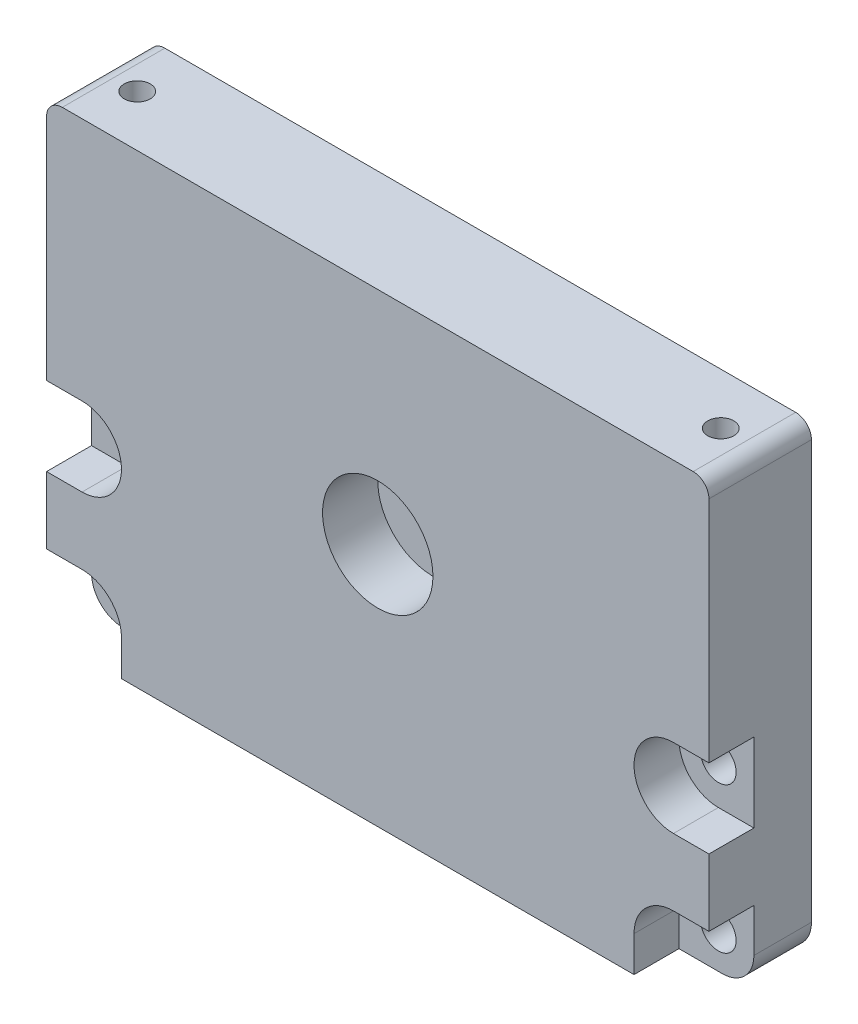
ISO-10303-21;
HEADER;
FILE_DESCRIPTION(('STEP AP214'),'2;1');
FILE_NAME('part.step','',(''),(''),'','','');
FILE_SCHEMA(('AUTOMOTIVE_DESIGN { 1 0 10303 214 1 1 1 1 }'));
ENDSEC;
DATA;
#1=APPLICATION_CONTEXT('core data for automotive mechanical design processes');
#2=APPLICATION_PROTOCOL_DEFINITION('international standard','automotive_design',2000,#1);
#3=PRODUCT_CONTEXT('',#1,'mechanical');
#4=PRODUCT('Part','Part','',(#3));
#5=PRODUCT_RELATED_PRODUCT_CATEGORY('part','',(#4));
#6=PRODUCT_DEFINITION_FORMATION('','',#4);
#7=PRODUCT_DEFINITION_CONTEXT('part definition',#1,'design');
#8=PRODUCT_DEFINITION('design','',#6,#7);
#9=PRODUCT_DEFINITION_SHAPE('','',#8);
#10=(LENGTH_UNIT() NAMED_UNIT(*) SI_UNIT(.MILLI.,.METRE.));
#11=(NAMED_UNIT(*) PLANE_ANGLE_UNIT() SI_UNIT($,.RADIAN.));
#12=(NAMED_UNIT(*) SI_UNIT($,.STERADIAN.) SOLID_ANGLE_UNIT());
#13=UNCERTAINTY_MEASURE_WITH_UNIT(LENGTH_MEASURE(1.E-05),#10,'distance_accuracy_value','');
#14=(GEOMETRIC_REPRESENTATION_CONTEXT(3) GLOBAL_UNCERTAINTY_ASSIGNED_CONTEXT((#13)) GLOBAL_UNIT_ASSIGNED_CONTEXT((#10,
#11,#12)) REPRESENTATION_CONTEXT('',''));
#15=CARTESIAN_POINT('',(0.,0.,0.));
#16=DIRECTION('',(0.,0.,1.));
#17=DIRECTION('',(1.,0.,0.));
#18=AXIS2_PLACEMENT_3D('',#15,#16,#17);
#19=CARTESIAN_POINT('',(-54.6053033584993,-1.18056755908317,6.));
#20=DIRECTION('',(0.,0.,1.));
#21=DIRECTION('',(1.,0.,0.));
#22=AXIS2_PLACEMENT_3D('',#19,#20,#21);
#23=PLANE('',#22);
#24=CARTESIAN_POINT('',(-54.6053033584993,-1.18056755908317,6.));
#25=DIRECTION('',(0.,0.,1.));
#26=DIRECTION('',(1.,0.,0.));
#27=AXIS2_PLACEMENT_3D('',#24,#25,#26);
#28=CIRCLE('',#27,7.);
#29=CARTESIAN_POINT('',(-47.6053033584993,-1.18056755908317,6.));
#30=VERTEX_POINT('',#29);
#31=EDGE_CURVE('E20',#30,#30,#28,.T.);
#32=ORIENTED_EDGE('',*,*,#31,.T.);
#33=EDGE_LOOP('',(#32));
#34=FACE_BOUND('',#33,.T.);
#35=ADVANCED_FACE('F17',(#34),#23,.T.);
#36=CARTESIAN_POINT('',(-91.6053033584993,16.7194324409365,6.5));
#37=DIRECTION('',(0.,1.,0.));
#38=DIRECTION('',(0.,0.,1.));
#39=AXIS2_PLACEMENT_3D('',#36,#37,#38);
#40=CONICAL_SURFACE('',#39,1.65000000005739,1.02974425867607);
#41=CARTESIAN_POINT('',(-91.6053033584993,15.7280124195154,6.5));
#42=VERTEX_POINT('',#41);
#43=VERTEX_LOOP('',#42);
#44=FACE_BOUND('',#43,.T.);
#45=CARTESIAN_POINT('',(-91.6053033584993,16.7194324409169,6.5));
#46=DIRECTION('',(0.,1.,0.));
#47=DIRECTION('',(0.,0.,1.));
#48=AXIS2_PLACEMENT_3D('',#45,#46,#47);
#49=CIRCLE('',#48,1.65);
#50=CARTESIAN_POINT('',(-91.6053033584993,16.7194324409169,8.15));
#51=VERTEX_POINT('',#50);
#52=EDGE_CURVE('E163',#51,#51,#49,.T.);
#53=ORIENTED_EDGE('',*,*,#52,.T.);
#54=EDGE_LOOP('',(#53));
#55=FACE_BOUND('',#54,.T.);
#56=ADVANCED_FACE('F157',(#44,#55),#40,.F.);
#57=CARTESIAN_POINT('',(-17.6053033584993,16.7194324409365,6.5));
#58=DIRECTION('',(0.,1.,0.));
#59=DIRECTION('',(0.,0.,1.));
#60=AXIS2_PLACEMENT_3D('',#57,#58,#59);
#61=CONICAL_SURFACE('',#60,1.65000000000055,1.02974425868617);
#62=CARTESIAN_POINT('',(-17.6053033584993,15.7280124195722,6.5));
#63=VERTEX_POINT('',#62);
#64=VERTEX_LOOP('',#63);
#65=FACE_BOUND('',#64,.T.);
#66=CARTESIAN_POINT('',(-17.6053033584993,16.7194324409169,6.5));
#67=DIRECTION('',(0.,1.,0.));
#68=DIRECTION('',(0.,0.,1.));
#69=AXIS2_PLACEMENT_3D('',#66,#67,#68);
#70=CIRCLE('',#69,1.65);
#71=CARTESIAN_POINT('',(-17.6053033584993,16.7194324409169,8.15));
#72=VERTEX_POINT('',#71);
#73=EDGE_CURVE('E166',#72,#72,#70,.T.);
#74=ORIENTED_EDGE('',*,*,#73,.T.);
#75=EDGE_LOOP('',(#74));
#76=FACE_BOUND('',#75,.T.);
#77=ADVANCED_FACE('F160',(#65,#76),#61,.F.);
#78=CARTESIAN_POINT('',(-92.1053033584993,-27.6805675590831,7.3));
#79=DIRECTION('',(0.,0.,1.));
#80=DIRECTION('',(1.,0.,0.));
#81=AXIS2_PLACEMENT_3D('',#78,#79,#80);
#82=CYLINDRICAL_SURFACE('',#81,4.99999999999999);
#83=DIRECTION('',(0.,0.,1.));
#84=VECTOR('',#83,1.);
#85=CARTESIAN_POINT('',(-92.1053033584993,-22.6805675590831,7.3));
#86=LINE('',#85,#84);
#87=CARTESIAN_POINT('',(-92.1053033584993,-22.6805675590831,13.));
#88=VERTEX_POINT('',#87);
#89=CARTESIAN_POINT('',(-92.1053033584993,-22.6805675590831,7.3));
#90=VERTEX_POINT('',#89);
#91=EDGE_CURVE('E326',#88,#90,#86,.F.);
#92=ORIENTED_EDGE('',*,*,#91,.T.);
#93=CARTESIAN_POINT('',(-92.1053033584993,-27.6805675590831,7.3));
#94=DIRECTION('',(0.,0.,1.));
#95=DIRECTION('',(1.,0.,0.));
#96=AXIS2_PLACEMENT_3D('',#93,#94,#95);
#97=CIRCLE('',#96,4.99999999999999);
#98=CARTESIAN_POINT('',(-87.1053033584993,-27.6805675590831,7.3));
#99=VERTEX_POINT('',#98);
#100=EDGE_CURVE('E315',#99,#90,#97,.T.);
#101=ORIENTED_EDGE('',*,*,#100,.F.);
#102=DIRECTION('',(0.,0.,-1.));
#103=VECTOR('',#102,1.);
#104=CARTESIAN_POINT('',(-87.1053033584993,-27.6805675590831,7.3));
#105=LINE('',#104,#103);
#106=CARTESIAN_POINT('',(-87.1053033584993,-27.6805675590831,13.));
#107=VERTEX_POINT('',#106);
#108=EDGE_CURVE('E342',#99,#107,#105,.F.);
#109=ORIENTED_EDGE('',*,*,#108,.T.);
#110=CARTESIAN_POINT('',(-92.1053033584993,-27.6805675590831,13.));
#111=DIRECTION('',(0.,0.,1.));
#112=DIRECTION('',(1.,0.,0.));
#113=AXIS2_PLACEMENT_3D('',#110,#111,#112);
#114=CIRCLE('',#113,4.99999999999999);
#115=EDGE_CURVE('E300',#88,#107,#114,.F.);
#116=ORIENTED_EDGE('',*,*,#115,.F.);
#117=EDGE_LOOP('',(#92,#101,#109,#116));
#118=FACE_BOUND('',#117,.T.);
#119=ADVANCED_FACE('F761',(#118),#82,.F.);
#120=CARTESIAN_POINT('',(-17.1053033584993,-27.680567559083,7.3));
#121=DIRECTION('',(0.,0.,1.));
#122=DIRECTION('',(1.,0.,0.));
#123=AXIS2_PLACEMENT_3D('',#120,#121,#122);
#124=CYLINDRICAL_SURFACE('',#123,5.);
#125=DIRECTION('',(0.,0.,1.));
#126=VECTOR('',#125,1.);
#127=CARTESIAN_POINT('',(-22.1053033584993,-27.680567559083,7.3));
#128=LINE('',#127,#126);
#129=CARTESIAN_POINT('',(-22.1053033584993,-27.680567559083,13.));
#130=VERTEX_POINT('',#129);
#131=CARTESIAN_POINT('',(-22.1053033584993,-27.680567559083,7.3));
#132=VERTEX_POINT('',#131);
#133=EDGE_CURVE('E318',#130,#132,#128,.F.);
#134=ORIENTED_EDGE('',*,*,#133,.T.);
#135=CARTESIAN_POINT('',(-17.1053033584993,-27.680567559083,7.3));
#136=DIRECTION('',(0.,0.,1.));
#137=DIRECTION('',(1.,0.,0.));
#138=AXIS2_PLACEMENT_3D('',#135,#136,#137);
#139=CIRCLE('',#138,5.);
#140=CARTESIAN_POINT('',(-17.1053033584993,-22.680567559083,7.3));
#141=VERTEX_POINT('',#140);
#142=EDGE_CURVE('E305',#141,#132,#139,.T.);
#143=ORIENTED_EDGE('',*,*,#142,.F.);
#144=DIRECTION('',(0.,0.,1.));
#145=VECTOR('',#144,1.);
#146=CARTESIAN_POINT('',(-17.1053033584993,-22.680567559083,7.3));
#147=LINE('',#146,#145);
#148=CARTESIAN_POINT('',(-17.1053033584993,-22.680567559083,13.));
#149=VERTEX_POINT('',#148);
#150=EDGE_CURVE('E167',#141,#149,#147,.T.);
#151=ORIENTED_EDGE('',*,*,#150,.T.);
#152=CARTESIAN_POINT('',(-17.1053033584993,-27.680567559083,13.));
#153=DIRECTION('',(0.,0.,1.));
#154=DIRECTION('',(1.,0.,0.));
#155=AXIS2_PLACEMENT_3D('',#152,#153,#154);
#156=CIRCLE('',#155,5.);
#157=EDGE_CURVE('E295',#130,#149,#156,.F.);
#158=ORIENTED_EDGE('',*,*,#157,.F.);
#159=EDGE_LOOP('',(#134,#143,#151,#158));
#160=FACE_BOUND('',#159,.T.);
#161=ADVANCED_FACE('F757',(#160),#124,.F.);
#162=CARTESIAN_POINT('',(-17.1053033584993,-9.18056755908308,7.3));
#163=DIRECTION('',(0.,0.,1.));
#164=DIRECTION('',(1.,0.,0.));
#165=AXIS2_PLACEMENT_3D('',#162,#163,#164);
#166=CYLINDRICAL_SURFACE('',#165,4.99999999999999);
#167=DIRECTION('',(0.,0.,-1.));
#168=VECTOR('',#167,1.);
#169=CARTESIAN_POINT('',(-17.1053033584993,-14.1805675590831,7.3));
#170=LINE('',#169,#168);
#171=CARTESIAN_POINT('',(-17.1053033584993,-14.1805675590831,13.));
#172=VERTEX_POINT('',#171);
#173=CARTESIAN_POINT('',(-17.1053033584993,-14.1805675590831,7.3));
#174=VERTEX_POINT('',#173);
#175=EDGE_CURVE('E314',#172,#174,#170,.T.);
#176=ORIENTED_EDGE('',*,*,#175,.T.);
#177=CARTESIAN_POINT('',(-17.1053033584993,-9.18056755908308,7.3));
#178=DIRECTION('',(0.,0.,1.));
#179=DIRECTION('',(1.,0.,0.));
#180=AXIS2_PLACEMENT_3D('',#177,#178,#179);
#181=CIRCLE('',#180,4.99999999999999);
#182=CARTESIAN_POINT('',(-17.1053033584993,-4.18056755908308,7.3));
#183=VERTEX_POINT('',#182);
#184=EDGE_CURVE('E310',#183,#174,#181,.T.);
#185=ORIENTED_EDGE('',*,*,#184,.F.);
#186=DIRECTION('',(0.,0.,1.));
#187=VECTOR('',#186,1.);
#188=CARTESIAN_POINT('',(-17.1053033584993,-4.18056755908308,7.3));
#189=LINE('',#188,#187);
#190=CARTESIAN_POINT('',(-17.1053033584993,-4.18056755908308,13.));
#191=VERTEX_POINT('',#190);
#192=EDGE_CURVE('E309',#183,#191,#189,.T.);
#193=ORIENTED_EDGE('',*,*,#192,.T.);
#194=CARTESIAN_POINT('',(-17.1053033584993,-9.18056755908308,13.));
#195=DIRECTION('',(0.,0.,1.));
#196=DIRECTION('',(1.,0.,0.));
#197=AXIS2_PLACEMENT_3D('',#194,#195,#196);
#198=CIRCLE('',#197,4.99999999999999);
#199=EDGE_CURVE('E290',#172,#191,#198,.F.);
#200=ORIENTED_EDGE('',*,*,#199,.F.);
#201=EDGE_LOOP('',(#176,#185,#193,#200));
#202=FACE_BOUND('',#201,.T.);
#203=ADVANCED_FACE('F754',(#202),#166,.F.);
#204=CARTESIAN_POINT('',(-92.1053033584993,-9.18056755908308,7.3));
#205=DIRECTION('',(0.,0.,1.));
#206=DIRECTION('',(1.,0.,0.));
#207=AXIS2_PLACEMENT_3D('',#204,#205,#206);
#208=CYLINDRICAL_SURFACE('',#207,5.);
#209=CARTESIAN_POINT('',(-92.1053033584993,-9.18056755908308,7.3));
#210=DIRECTION('',(0.,0.,1.));
#211=DIRECTION('',(1.,0.,0.));
#212=AXIS2_PLACEMENT_3D('',#209,#210,#211);
#213=CIRCLE('',#212,5.);
#214=CARTESIAN_POINT('',(-92.1053033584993,-14.1805675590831,7.3));
#215=VERTEX_POINT('',#214);
#216=CARTESIAN_POINT('',(-92.1053033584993,-4.18056755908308,7.3));
#217=VERTEX_POINT('',#216);
#218=EDGE_CURVE('E143',#215,#217,#213,.T.);
#219=ORIENTED_EDGE('',*,*,#218,.F.);
#220=DIRECTION('',(0.,0.,-1.));
#221=VECTOR('',#220,1.);
#222=CARTESIAN_POINT('',(-92.1053033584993,-14.1805675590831,7.3));
#223=LINE('',#222,#221);
#224=CARTESIAN_POINT('',(-92.1053033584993,-14.1805675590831,13.));
#225=VERTEX_POINT('',#224);
#226=EDGE_CURVE('E185',#215,#225,#223,.F.);
#227=ORIENTED_EDGE('',*,*,#226,.T.);
#228=CARTESIAN_POINT('',(-92.1053033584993,-9.18056755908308,13.));
#229=DIRECTION('',(0.,0.,1.));
#230=DIRECTION('',(1.,0.,0.));
#231=AXIS2_PLACEMENT_3D('',#228,#229,#230);
#232=CIRCLE('',#231,5.);
#233=CARTESIAN_POINT('',(-92.1053033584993,-4.18056755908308,13.));
#234=VERTEX_POINT('',#233);
#235=EDGE_CURVE('E285',#234,#225,#232,.F.);
#236=ORIENTED_EDGE('',*,*,#235,.F.);
#237=DIRECTION('',(0.,0.,1.));
#238=VECTOR('',#237,1.);
#239=CARTESIAN_POINT('',(-92.1053033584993,-4.18056755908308,7.3));
#240=LINE('',#239,#238);
#241=EDGE_CURVE('E320',#234,#217,#240,.F.);
#242=ORIENTED_EDGE('',*,*,#241,.T.);
#243=EDGE_LOOP('',(#219,#227,#236,#242));
#244=FACE_BOUND('',#243,.T.);
#245=ADVANCED_FACE('F750',(#244),#208,.F.);
#246=CARTESIAN_POINT('',(-54.6053033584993,-1.18056755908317,6.));
#247=DIRECTION('',(0.,0.,1.));
#248=DIRECTION('',(1.,0.,0.));
#249=AXIS2_PLACEMENT_3D('',#246,#247,#248);
#250=CYLINDRICAL_SURFACE('',#249,7.);
#251=CARTESIAN_POINT('',(-54.6053033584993,-1.18056755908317,13.));
#252=DIRECTION('',(0.,0.,1.));
#253=DIRECTION('',(1.,0.,0.));
#254=AXIS2_PLACEMENT_3D('',#251,#252,#253);
#255=CIRCLE('',#254,7.);
#256=CARTESIAN_POINT('',(-47.6053033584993,-1.18056755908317,13.));
#257=VERTEX_POINT('',#256);
#258=EDGE_CURVE('E281',#257,#257,#255,.F.);
#259=ORIENTED_EDGE('',*,*,#258,.F.);
#260=EDGE_LOOP('',(#259));
#261=FACE_BOUND('',#260,.T.);
#262=ORIENTED_EDGE('',*,*,#31,.F.);
#263=EDGE_LOOP('',(#262));
#264=FACE_BOUND('',#263,.T.);
#265=ADVANCED_FACE('F747',(#261,#264),#250,.F.);
#266=CARTESIAN_POINT('',(-37.4053033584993,6.81943244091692,4.99999999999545));
#267=DIRECTION('',(0.,0.,-1.));
#268=DIRECTION('',(-1.,0.,0.));
#269=AXIS2_PLACEMENT_3D('',#266,#267,#268);
#270=CONICAL_SURFACE('',#269,3.74999999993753,1.029744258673);
#271=CARTESIAN_POINT('',(-37.4053033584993,6.81943244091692,7.25322732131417));
#272=VERTEX_POINT('',#271);
#273=VERTEX_LOOP('',#272);
#274=FACE_BOUND('',#273,.T.);
#275=CARTESIAN_POINT('',(-37.4053033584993,6.81943244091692,5.));
#276=DIRECTION('',(0.,0.,-1.));
#277=DIRECTION('',(-1.,0.,0.));
#278=AXIS2_PLACEMENT_3D('',#275,#276,#277);
#279=CIRCLE('',#278,3.74999999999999);
#280=CARTESIAN_POINT('',(-41.1553033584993,6.81943244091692,5.));
#281=VERTEX_POINT('',#280);
#282=EDGE_CURVE('E280',#281,#281,#279,.T.);
#283=ORIENTED_EDGE('',*,*,#282,.T.);
#284=EDGE_LOOP('',(#283));
#285=FACE_BOUND('',#284,.T.);
#286=ADVANCED_FACE('F743',(#274,#285),#270,.F.);
#287=CARTESIAN_POINT('',(-107.914889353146,-22.6805675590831,7.3));
#288=DIRECTION('',(0.,1.,0.));
#289=DIRECTION('',(0.,0.,1.));
#290=AXIS2_PLACEMENT_3D('',#287,#288,#289);
#291=PLANE('',#290);
#292=ORIENTED_EDGE('',*,*,#91,.F.);
#293=DIRECTION('',(1.,0.,0.));
#294=VECTOR('',#293,1.);
#295=CARTESIAN_POINT('',(0.,-22.6805675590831,13.));
#296=LINE('',#295,#294);
#297=CARTESIAN_POINT('',(-96.6053033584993,-22.6805675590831,13.));
#298=VERTEX_POINT('',#297);
#299=EDGE_CURVE('E304',#298,#88,#296,.T.);
#300=ORIENTED_EDGE('',*,*,#299,.F.);
#301=DIRECTION('',(0.,0.,-1.));
#302=VECTOR('',#301,1.);
#303=CARTESIAN_POINT('',(-96.6053033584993,-22.6805675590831,13.));
#304=LINE('',#303,#302);
#305=CARTESIAN_POINT('',(-96.6053033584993,-22.6805675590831,7.3));
#306=VERTEX_POINT('',#305);
#307=EDGE_CURVE('E263',#298,#306,#304,.T.);
#308=ORIENTED_EDGE('',*,*,#307,.T.);
#309=DIRECTION('',(1.,0.,0.));
#310=VECTOR('',#309,1.);
#311=CARTESIAN_POINT('',(-92.1053033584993,-22.6805675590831,7.3));
#312=LINE('',#311,#310);
#313=EDGE_CURVE('E317',#90,#306,#312,.F.);
#314=ORIENTED_EDGE('',*,*,#313,.F.);
#315=EDGE_LOOP('',(#292,#300,#308,#314));
#316=FACE_BOUND('',#315,.T.);
#317=ADVANCED_FACE('F740',(#316),#291,.F.);
#318=CARTESIAN_POINT('',(-92.1053033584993,-4.18056755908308,7.3));
#319=DIRECTION('',(0.,1.,0.));
#320=DIRECTION('',(-1.,0.,0.));
#321=AXIS2_PLACEMENT_3D('',#318,#319,#320);
#322=PLANE('',#321);
#323=DIRECTION('',(0.,0.,-1.));
#324=VECTOR('',#323,1.);
#325=CARTESIAN_POINT('',(-96.6053033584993,-4.18056755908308,13.));
#326=LINE('',#325,#324);
#327=CARTESIAN_POINT('',(-96.6053033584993,-4.18056755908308,13.));
#328=VERTEX_POINT('',#327);
#329=CARTESIAN_POINT('',(-96.6053033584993,-4.18056755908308,7.3));
#330=VERTEX_POINT('',#329);
#331=EDGE_CURVE('E194',#328,#330,#326,.T.);
#332=ORIENTED_EDGE('',*,*,#331,.T.);
#333=DIRECTION('',(1.,0.,0.));
#334=VECTOR('',#333,1.);
#335=CARTESIAN_POINT('',(-92.1053033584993,-4.18056755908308,7.3));
#336=LINE('',#335,#334);
#337=EDGE_CURVE('E186',#217,#330,#336,.F.);
#338=ORIENTED_EDGE('',*,*,#337,.F.);
#339=ORIENTED_EDGE('',*,*,#241,.F.);
#340=DIRECTION('',(1.,0.,0.));
#341=VECTOR('',#340,1.);
#342=CARTESIAN_POINT('',(0.,-4.18056755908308,13.));
#343=LINE('',#342,#341);
#344=EDGE_CURVE('E289',#328,#234,#343,.T.);
#345=ORIENTED_EDGE('',*,*,#344,.F.);
#346=EDGE_LOOP('',(#332,#338,#339,#345));
#347=FACE_BOUND('',#346,.T.);
#348=ADVANCED_FACE('F655',(#347),#322,.F.);
#349=CARTESIAN_POINT('',(-92.1053033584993,-9.18056755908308,7.3));
#350=DIRECTION('',(0.,0.,1.));
#351=DIRECTION('',(1.,0.,0.));
#352=AXIS2_PLACEMENT_3D('',#349,#350,#351);
#353=PLANE('',#352);
#354=ORIENTED_EDGE('',*,*,#218,.T.);
#355=ORIENTED_EDGE('',*,*,#337,.T.);
#356=DIRECTION('',(0.,1.,0.));
#357=VECTOR('',#356,1.);
#358=CARTESIAN_POINT('',(-96.6053033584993,26.8194324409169,7.3));
#359=LINE('',#358,#357);
#360=CARTESIAN_POINT('',(-96.6053033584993,-14.1805675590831,7.3));
#361=VERTEX_POINT('',#360);
#362=EDGE_CURVE('E189',#330,#361,#359,.F.);
#363=ORIENTED_EDGE('',*,*,#362,.T.);
#364=DIRECTION('',(1.,0.,0.));
#365=VECTOR('',#364,1.);
#366=CARTESIAN_POINT('',(-92.1053033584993,-14.1805675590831,7.3));
#367=LINE('',#366,#365);
#368=EDGE_CURVE('E182',#361,#215,#367,.T.);
#369=ORIENTED_EDGE('',*,*,#368,.T.);
#370=EDGE_LOOP('',(#354,#355,#363,#369));
#371=FACE_BOUND('',#370,.T.);
#372=CARTESIAN_POINT('',(-92.1053033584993,-9.18056755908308,7.3));
#373=DIRECTION('',(0.,0.,1.));
#374=DIRECTION('',(1.,0.,0.));
#375=AXIS2_PLACEMENT_3D('',#372,#373,#374);
#376=CIRCLE('',#375,2.25);
#377=CARTESIAN_POINT('',(-89.8553033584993,-9.18056755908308,7.3));
#378=VERTEX_POINT('',#377);
#379=EDGE_CURVE('E276',#378,#378,#376,.F.);
#380=ORIENTED_EDGE('',*,*,#379,.T.);
#381=EDGE_LOOP('',(#380));
#382=FACE_BOUND('',#381,.T.);
#383=ADVANCED_FACE('F656',(#371,#382),#353,.T.);
#384=CARTESIAN_POINT('',(-92.1053033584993,-14.1805675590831,7.3));
#385=DIRECTION('',(0.,-1.,0.));
#386=DIRECTION('',(0.,0.,-1.));
#387=AXIS2_PLACEMENT_3D('',#384,#385,#386);
#388=PLANE('',#387);
#389=ORIENTED_EDGE('',*,*,#226,.F.);
#390=ORIENTED_EDGE('',*,*,#368,.F.);
#391=DIRECTION('',(0.,0.,-1.));
#392=VECTOR('',#391,1.);
#393=CARTESIAN_POINT('',(-96.6053033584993,-14.1805675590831,13.));
#394=LINE('',#393,#392);
#395=CARTESIAN_POINT('',(-96.6053033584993,-14.1805675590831,13.));
#396=VERTEX_POINT('',#395);
#397=EDGE_CURVE('E193',#361,#396,#394,.F.);
#398=ORIENTED_EDGE('',*,*,#397,.T.);
#399=DIRECTION('',(1.,0.,0.));
#400=VECTOR('',#399,1.);
#401=CARTESIAN_POINT('',(0.,-14.1805675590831,13.));
#402=LINE('',#401,#400);
#403=EDGE_CURVE('E174',#225,#396,#402,.F.);
#404=ORIENTED_EDGE('',*,*,#403,.F.);
#405=EDGE_LOOP('',(#389,#390,#398,#404));
#406=FACE_BOUND('',#405,.T.);
#407=ADVANCED_FACE('F659',(#406),#388,.F.);
#408=CARTESIAN_POINT('',(-22.1053033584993,-27.680567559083,7.3));
#409=DIRECTION('',(-1.,0.,0.));
#410=DIRECTION('',(0.,-1.,0.));
#411=AXIS2_PLACEMENT_3D('',#408,#409,#410);
#412=PLANE('',#411);
#413=ORIENTED_EDGE('',*,*,#133,.F.);
#414=DIRECTION('',(0.,1.,0.));
#415=VECTOR('',#414,1.);
#416=CARTESIAN_POINT('',(-22.1053033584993,0.,13.));
#417=LINE('',#416,#415);
#418=CARTESIAN_POINT('',(-22.1053033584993,-32.1805675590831,13.));
#419=VERTEX_POINT('',#418);
#420=EDGE_CURVE('E299',#419,#130,#417,.T.);
#421=ORIENTED_EDGE('',*,*,#420,.F.);
#422=DIRECTION('',(0.,0.,1.));
#423=VECTOR('',#422,1.);
#424=CARTESIAN_POINT('',(-22.1053033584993,-32.1805675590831,13.));
#425=LINE('',#424,#423);
#426=CARTESIAN_POINT('',(-22.1053033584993,-32.1805675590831,7.3));
#427=VERTEX_POINT('',#426);
#428=EDGE_CURVE('E403',#419,#427,#425,.F.);
#429=ORIENTED_EDGE('',*,*,#428,.T.);
#430=DIRECTION('',(0.,1.,0.));
#431=VECTOR('',#430,1.);
#432=CARTESIAN_POINT('',(-22.1053033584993,-27.680567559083,7.3));
#433=LINE('',#432,#431);
#434=EDGE_CURVE('E308',#132,#427,#433,.F.);
#435=ORIENTED_EDGE('',*,*,#434,.F.);
#436=EDGE_LOOP('',(#413,#421,#429,#435));
#437=FACE_BOUND('',#436,.T.);
#438=ADVANCED_FACE('F638',(#437),#412,.F.);
#439=CARTESIAN_POINT('',(-92.1053033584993,-27.6805675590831,7.3));
#440=DIRECTION('',(0.,0.,1.));
#441=DIRECTION('',(1.,0.,0.));
#442=AXIS2_PLACEMENT_3D('',#439,#440,#441);
#443=PLANE('',#442);
#444=ORIENTED_EDGE('',*,*,#100,.T.);
#445=ORIENTED_EDGE('',*,*,#313,.T.);
#446=DIRECTION('',(0.,1.,0.));
#447=VECTOR('',#446,1.);
#448=CARTESIAN_POINT('',(-96.6053033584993,26.8194324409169,7.3));
#449=LINE('',#448,#447);
#450=CARTESIAN_POINT('',(-96.6053033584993,-28.1805675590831,7.3));
#451=VERTEX_POINT('',#450);
#452=EDGE_CURVE('E376',#306,#451,#449,.F.);
#453=ORIENTED_EDGE('',*,*,#452,.T.);
#454=CARTESIAN_POINT('',(-92.6053033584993,-28.1805675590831,7.3));
#455=DIRECTION('',(0.,0.,-1.));
#456=DIRECTION('',(-1.,0.,0.));
#457=AXIS2_PLACEMENT_3D('',#454,#455,#456);
#458=CIRCLE('',#457,4.);
#459=CARTESIAN_POINT('',(-92.6053033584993,-32.1805675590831,7.3));
#460=VERTEX_POINT('',#459);
#461=EDGE_CURVE('E255',#460,#451,#458,.T.);
#462=ORIENTED_EDGE('',*,*,#461,.F.);
#463=DIRECTION('',(1.,0.,0.));
#464=VECTOR('',#463,1.);
#465=CARTESIAN_POINT('',(-96.6053033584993,-32.1805675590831,7.3));
#466=LINE('',#465,#464);
#467=CARTESIAN_POINT('',(-87.1053033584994,-32.1805675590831,7.3));
#468=VERTEX_POINT('',#467);
#469=EDGE_CURVE('E417',#460,#468,#466,.T.);
#470=ORIENTED_EDGE('',*,*,#469,.T.);
#471=DIRECTION('',(0.,1.,0.));
#472=VECTOR('',#471,1.);
#473=CARTESIAN_POINT('',(-87.1053033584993,-27.6805675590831,7.3));
#474=LINE('',#473,#472);
#475=EDGE_CURVE('E349',#468,#99,#474,.T.);
#476=ORIENTED_EDGE('',*,*,#475,.T.);
#477=EDGE_LOOP('',(#444,#445,#453,#462,#470,#476));
#478=FACE_BOUND('',#477,.T.);
#479=CARTESIAN_POINT('',(-92.1053033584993,-27.6805675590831,7.3));
#480=DIRECTION('',(0.,0.,1.));
#481=DIRECTION('',(1.,0.,0.));
#482=AXIS2_PLACEMENT_3D('',#479,#480,#481);
#483=CIRCLE('',#482,2.25);
#484=CARTESIAN_POINT('',(-89.8553033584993,-27.6805675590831,7.3));
#485=VERTEX_POINT('',#484);
#486=EDGE_CURVE('E272',#485,#485,#483,.F.);
#487=ORIENTED_EDGE('',*,*,#486,.T.);
#488=EDGE_LOOP('',(#487));
#489=FACE_BOUND('',#488,.T.);
#490=ADVANCED_FACE('F729',(#478,#489),#443,.T.);
#491=CARTESIAN_POINT('',(-87.1053033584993,-27.6805675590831,7.3));
#492=DIRECTION('',(1.,0.,0.));
#493=DIRECTION('',(0.,0.,-1.));
#494=AXIS2_PLACEMENT_3D('',#491,#492,#493);
#495=PLANE('',#494);
#496=ORIENTED_EDGE('',*,*,#108,.F.);
#497=ORIENTED_EDGE('',*,*,#475,.F.);
#498=DIRECTION('',(0.,0.,1.));
#499=VECTOR('',#498,1.);
#500=CARTESIAN_POINT('',(-87.1053033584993,-32.1805675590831,13.));
#501=LINE('',#500,#499);
#502=CARTESIAN_POINT('',(-87.1053033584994,-32.1805675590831,13.));
#503=VERTEX_POINT('',#502);
#504=EDGE_CURVE('E400',#468,#503,#501,.T.);
#505=ORIENTED_EDGE('',*,*,#504,.T.);
#506=DIRECTION('',(0.,1.,0.));
#507=VECTOR('',#506,1.);
#508=CARTESIAN_POINT('',(-87.1053033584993,0.,13.));
#509=LINE('',#508,#507);
#510=EDGE_CURVE('E303',#107,#503,#509,.F.);
#511=ORIENTED_EDGE('',*,*,#510,.F.);
#512=EDGE_LOOP('',(#496,#497,#505,#511));
#513=FACE_BOUND('',#512,.T.);
#514=ADVANCED_FACE('F726',(#513),#495,.F.);
#515=CARTESIAN_POINT('',(-17.1053033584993,-14.1805675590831,7.3));
#516=DIRECTION('',(0.,-1.,0.));
#517=DIRECTION('',(0.,0.,-1.));
#518=AXIS2_PLACEMENT_3D('',#515,#516,#517);
#519=PLANE('',#518);
#520=DIRECTION('',(0.,0.,1.));
#521=VECTOR('',#520,1.);
#522=CARTESIAN_POINT('',(-12.6053033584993,-14.1805675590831,13.));
#523=LINE('',#522,#521);
#524=CARTESIAN_POINT('',(-12.6053033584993,-14.1805675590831,13.));
#525=VERTEX_POINT('',#524);
#526=CARTESIAN_POINT('',(-12.6053033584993,-14.1805675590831,7.3));
#527=VERTEX_POINT('',#526);
#528=EDGE_CURVE('E442',#525,#527,#523,.F.);
#529=ORIENTED_EDGE('',*,*,#528,.T.);
#530=DIRECTION('',(1.,0.,0.));
#531=VECTOR('',#530,1.);
#532=CARTESIAN_POINT('',(-17.1053033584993,-14.1805675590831,7.3));
#533=LINE('',#532,#531);
#534=EDGE_CURVE('E313',#174,#527,#533,.T.);
#535=ORIENTED_EDGE('',*,*,#534,.F.);
#536=ORIENTED_EDGE('',*,*,#175,.F.);
#537=DIRECTION('',(1.,0.,0.));
#538=VECTOR('',#537,1.);
#539=CARTESIAN_POINT('',(0.,-14.1805675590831,13.));
#540=LINE('',#539,#538);
#541=EDGE_CURVE('E294',#525,#172,#540,.F.);
#542=ORIENTED_EDGE('',*,*,#541,.F.);
#543=EDGE_LOOP('',(#529,#535,#536,#542));
#544=FACE_BOUND('',#543,.T.);
#545=ADVANCED_FACE('F622',(#544),#519,.F.);
#546=CARTESIAN_POINT('',(-17.1053033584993,-9.18056755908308,7.3));
#547=DIRECTION('',(0.,0.,1.));
#548=DIRECTION('',(1.,0.,0.));
#549=AXIS2_PLACEMENT_3D('',#546,#547,#548);
#550=PLANE('',#549);
#551=ORIENTED_EDGE('',*,*,#184,.T.);
#552=ORIENTED_EDGE('',*,*,#534,.T.);
#553=DIRECTION('',(0.,-1.,0.));
#554=VECTOR('',#553,1.);
#555=CARTESIAN_POINT('',(-12.6053033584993,26.8194324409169,7.3));
#556=LINE('',#555,#554);
#557=CARTESIAN_POINT('',(-12.6053033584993,-4.18056755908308,7.3));
#558=VERTEX_POINT('',#557);
#559=EDGE_CURVE('E446',#527,#558,#556,.F.);
#560=ORIENTED_EDGE('',*,*,#559,.T.);
#561=DIRECTION('',(1.,0.,0.));
#562=VECTOR('',#561,1.);
#563=CARTESIAN_POINT('',(-17.1053033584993,-4.18056755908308,7.3));
#564=LINE('',#563,#562);
#565=EDGE_CURVE('E340',#558,#183,#564,.F.);
#566=ORIENTED_EDGE('',*,*,#565,.T.);
#567=EDGE_LOOP('',(#551,#552,#560,#566));
#568=FACE_BOUND('',#567,.T.);
#569=CARTESIAN_POINT('',(-17.1053033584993,-9.18056755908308,7.3));
#570=DIRECTION('',(0.,0.,1.));
#571=DIRECTION('',(1.,0.,0.));
#572=AXIS2_PLACEMENT_3D('',#569,#570,#571);
#573=CIRCLE('',#572,2.25);
#574=CARTESIAN_POINT('',(-14.8553033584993,-9.18056755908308,7.3));
#575=VERTEX_POINT('',#574);
#576=EDGE_CURVE('E264',#575,#575,#573,.F.);
#577=ORIENTED_EDGE('',*,*,#576,.T.);
#578=EDGE_LOOP('',(#577));
#579=FACE_BOUND('',#578,.T.);
#580=ADVANCED_FACE('F614',(#568,#579),#550,.T.);
#581=CARTESIAN_POINT('',(-17.1053033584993,-4.18056755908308,7.3));
#582=DIRECTION('',(0.,1.,0.));
#583=DIRECTION('',(0.,0.,1.));
#584=AXIS2_PLACEMENT_3D('',#581,#582,#583);
#585=PLANE('',#584);
#586=ORIENTED_EDGE('',*,*,#192,.F.);
#587=ORIENTED_EDGE('',*,*,#565,.F.);
#588=DIRECTION('',(0.,0.,1.));
#589=VECTOR('',#588,1.);
#590=CARTESIAN_POINT('',(-12.6053033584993,-4.18056755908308,13.));
#591=LINE('',#590,#589);
#592=CARTESIAN_POINT('',(-12.6053033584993,-4.18056755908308,13.));
#593=VERTEX_POINT('',#592);
#594=EDGE_CURVE('E456',#558,#593,#591,.T.);
#595=ORIENTED_EDGE('',*,*,#594,.T.);
#596=DIRECTION('',(1.,0.,0.));
#597=VECTOR('',#596,1.);
#598=CARTESIAN_POINT('',(0.,-4.18056755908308,13.));
#599=LINE('',#598,#597);
#600=EDGE_CURVE('E293',#191,#593,#599,.T.);
#601=ORIENTED_EDGE('',*,*,#600,.F.);
#602=EDGE_LOOP('',(#586,#587,#595,#601));
#603=FACE_BOUND('',#602,.T.);
#604=ADVANCED_FACE('F610',(#603),#585,.F.);
#605=CARTESIAN_POINT('',(-17.1053033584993,-27.680567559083,7.3));
#606=DIRECTION('',(0.,0.,1.));
#607=DIRECTION('',(1.,0.,0.));
#608=AXIS2_PLACEMENT_3D('',#605,#606,#607);
#609=PLANE('',#608);
#610=ORIENTED_EDGE('',*,*,#142,.T.);
#611=ORIENTED_EDGE('',*,*,#434,.T.);
#612=DIRECTION('',(1.,0.,0.));
#613=VECTOR('',#612,1.);
#614=CARTESIAN_POINT('',(-96.6053033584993,-32.1805675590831,7.3));
#615=LINE('',#614,#613);
#616=CARTESIAN_POINT('',(-16.6053033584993,-32.1805675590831,7.3));
#617=VERTEX_POINT('',#616);
#618=EDGE_CURVE('E407',#427,#617,#615,.T.);
#619=ORIENTED_EDGE('',*,*,#618,.T.);
#620=CARTESIAN_POINT('',(-16.6053033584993,-28.1805675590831,7.3));
#621=DIRECTION('',(0.,0.,-1.));
#622=DIRECTION('',(-1.,0.,0.));
#623=AXIS2_PLACEMENT_3D('',#620,#621,#622);
#624=CIRCLE('',#623,4.);
#625=CARTESIAN_POINT('',(-12.6053033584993,-28.1805675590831,7.3));
#626=VERTEX_POINT('',#625);
#627=EDGE_CURVE('E250',#626,#617,#624,.T.);
#628=ORIENTED_EDGE('',*,*,#627,.F.);
#629=DIRECTION('',(0.,-1.,0.));
#630=VECTOR('',#629,1.);
#631=CARTESIAN_POINT('',(-12.6053033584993,26.8194324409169,7.3));
#632=LINE('',#631,#630);
#633=CARTESIAN_POINT('',(-12.6053033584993,-22.680567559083,7.3));
#634=VERTEX_POINT('',#633);
#635=EDGE_CURVE('E478',#626,#634,#632,.F.);
#636=ORIENTED_EDGE('',*,*,#635,.T.);
#637=DIRECTION('',(1.,0.,0.));
#638=VECTOR('',#637,1.);
#639=CARTESIAN_POINT('',(-17.1053033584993,-22.680567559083,7.3));
#640=LINE('',#639,#638);
#641=EDGE_CURVE('E178',#634,#141,#640,.F.);
#642=ORIENTED_EDGE('',*,*,#641,.T.);
#643=EDGE_LOOP('',(#610,#611,#619,#628,#636,#642));
#644=FACE_BOUND('',#643,.T.);
#645=CARTESIAN_POINT('',(-17.1053033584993,-27.680567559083,7.3));
#646=DIRECTION('',(0.,0.,1.));
#647=DIRECTION('',(1.,0.,0.));
#648=AXIS2_PLACEMENT_3D('',#645,#646,#647);
#649=CIRCLE('',#648,2.25);
#650=CARTESIAN_POINT('',(-14.8553033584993,-27.680567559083,7.3));
#651=VERTEX_POINT('',#650);
#652=EDGE_CURVE('E268',#651,#651,#649,.F.);
#653=ORIENTED_EDGE('',*,*,#652,.T.);
#654=EDGE_LOOP('',(#653));
#655=FACE_BOUND('',#654,.T.);
#656=ADVANCED_FACE('F633',(#644,#655),#609,.T.);
#657=CARTESIAN_POINT('',(-17.1053033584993,-22.680567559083,7.3));
#658=DIRECTION('',(0.,1.,0.));
#659=DIRECTION('',(0.,0.,1.));
#660=AXIS2_PLACEMENT_3D('',#657,#658,#659);
#661=PLANE('',#660);
#662=ORIENTED_EDGE('',*,*,#150,.F.);
#663=ORIENTED_EDGE('',*,*,#641,.F.);
#664=DIRECTION('',(0.,0.,1.));
#665=VECTOR('',#664,1.);
#666=CARTESIAN_POINT('',(-12.6053033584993,-22.680567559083,13.));
#667=LINE('',#666,#665);
#668=CARTESIAN_POINT('',(-12.6053033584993,-22.680567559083,13.));
#669=VERTEX_POINT('',#668);
#670=EDGE_CURVE('E439',#634,#669,#667,.T.);
#671=ORIENTED_EDGE('',*,*,#670,.T.);
#672=DIRECTION('',(1.,0.,0.));
#673=VECTOR('',#672,1.);
#674=CARTESIAN_POINT('',(0.,-22.680567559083,13.));
#675=LINE('',#674,#673);
#676=EDGE_CURVE('E298',#149,#669,#675,.T.);
#677=ORIENTED_EDGE('',*,*,#676,.F.);
#678=EDGE_LOOP('',(#662,#663,#671,#677));
#679=FACE_BOUND('',#678,.T.);
#680=ADVANCED_FACE('F630',(#679),#661,.F.);
#681=CARTESIAN_POINT('',(-91.6053033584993,26.8194324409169,6.5));
#682=DIRECTION('',(0.,1.,0.));
#683=DIRECTION('',(0.,0.,1.));
#684=AXIS2_PLACEMENT_3D('',#681,#682,#683);
#685=CYLINDRICAL_SURFACE('',#684,1.65);
#686=ORIENTED_EDGE('',*,*,#52,.F.);
#687=EDGE_LOOP('',(#686));
#688=FACE_BOUND('',#687,.T.);
#689=CARTESIAN_POINT('',(-91.6053033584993,26.8194324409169,6.5));
#690=DIRECTION('',(0.,1.,0.));
#691=DIRECTION('',(0.,0.,1.));
#692=AXIS2_PLACEMENT_3D('',#689,#690,#691);
#693=CIRCLE('',#692,1.65);
#694=CARTESIAN_POINT('',(-91.6053033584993,26.8194324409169,8.15));
#695=VERTEX_POINT('',#694);
#696=EDGE_CURVE('E241',#695,#695,#693,.T.);
#697=ORIENTED_EDGE('',*,*,#696,.T.);
#698=EDGE_LOOP('',(#697));
#699=FACE_BOUND('',#698,.T.);
#700=ADVANCED_FACE('F717',(#688,#699),#685,.F.);
#701=CARTESIAN_POINT('',(-17.6053033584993,26.8194324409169,6.5));
#702=DIRECTION('',(0.,1.,0.));
#703=DIRECTION('',(0.,0.,1.));
#704=AXIS2_PLACEMENT_3D('',#701,#702,#703);
#705=CYLINDRICAL_SURFACE('',#704,1.65);
#706=ORIENTED_EDGE('',*,*,#73,.F.);
#707=EDGE_LOOP('',(#706));
#708=FACE_BOUND('',#707,.T.);
#709=CARTESIAN_POINT('',(-17.6053033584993,26.8194324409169,6.5));
#710=DIRECTION('',(0.,1.,0.));
#711=DIRECTION('',(0.,0.,1.));
#712=AXIS2_PLACEMENT_3D('',#709,#710,#711);
#713=CIRCLE('',#712,1.65);
#714=CARTESIAN_POINT('',(-17.6053033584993,26.8194324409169,8.15));
#715=VERTEX_POINT('',#714);
#716=EDGE_CURVE('E236',#715,#715,#713,.T.);
#717=ORIENTED_EDGE('',*,*,#716,.T.);
#718=EDGE_LOOP('',(#717));
#719=FACE_BOUND('',#718,.T.);
#720=ADVANCED_FACE('F773',(#708,#719),#705,.F.);
#721=CARTESIAN_POINT('',(0.,0.,13.));
#722=DIRECTION('',(0.,0.,1.));
#723=DIRECTION('',(1.,0.,0.));
#724=AXIS2_PLACEMENT_3D('',#721,#722,#723);
#725=PLANE('',#724);
#726=ORIENTED_EDGE('',*,*,#258,.T.);
#727=EDGE_LOOP('',(#726));
#728=FACE_BOUND('',#727,.T.);
#729=ORIENTED_EDGE('',*,*,#344,.T.);
#730=ORIENTED_EDGE('',*,*,#235,.T.);
#731=ORIENTED_EDGE('',*,*,#403,.T.);
#732=DIRECTION('',(0.,1.,0.));
#733=VECTOR('',#732,1.);
#734=CARTESIAN_POINT('',(-96.6053033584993,26.8194324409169,13.));
#735=LINE('',#734,#733);
#736=EDGE_CURVE('E259',#396,#298,#735,.F.);
#737=ORIENTED_EDGE('',*,*,#736,.T.);
#738=ORIENTED_EDGE('',*,*,#299,.T.);
#739=ORIENTED_EDGE('',*,*,#115,.T.);
#740=ORIENTED_EDGE('',*,*,#510,.T.);
#741=DIRECTION('',(1.,0.,0.));
#742=VECTOR('',#741,1.);
#743=CARTESIAN_POINT('',(-96.6053033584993,-32.1805675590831,13.));
#744=LINE('',#743,#742);
#745=EDGE_CURVE('E254',#503,#419,#744,.T.);
#746=ORIENTED_EDGE('',*,*,#745,.T.);
#747=ORIENTED_EDGE('',*,*,#420,.T.);
#748=ORIENTED_EDGE('',*,*,#157,.T.);
#749=ORIENTED_EDGE('',*,*,#676,.T.);
#750=DIRECTION('',(0.,-1.,0.));
#751=VECTOR('',#750,1.);
#752=CARTESIAN_POINT('',(-12.6053033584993,26.8194324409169,13.));
#753=LINE('',#752,#751);
#754=EDGE_CURVE('E249',#669,#525,#753,.F.);
#755=ORIENTED_EDGE('',*,*,#754,.T.);
#756=ORIENTED_EDGE('',*,*,#541,.T.);
#757=ORIENTED_EDGE('',*,*,#199,.T.);
#758=ORIENTED_EDGE('',*,*,#600,.T.);
#759=DIRECTION('',(0.,-1.,0.));
#760=VECTOR('',#759,1.);
#761=CARTESIAN_POINT('',(-12.6053033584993,26.8194324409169,13.));
#762=LINE('',#761,#760);
#763=CARTESIAN_POINT('',(-12.6053033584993,24.8194324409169,13.));
#764=VERTEX_POINT('',#763);
#765=EDGE_CURVE('E467',#593,#764,#762,.F.);
#766=ORIENTED_EDGE('',*,*,#765,.T.);
#767=CARTESIAN_POINT('',(-14.6053033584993,24.8194324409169,13.));
#768=DIRECTION('',(0.,0.,-1.));
#769=DIRECTION('',(-1.,0.,0.));
#770=AXIS2_PLACEMENT_3D('',#767,#768,#769);
#771=CIRCLE('',#770,2.);
#772=CARTESIAN_POINT('',(-14.6053033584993,26.8194324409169,13.));
#773=VERTEX_POINT('',#772);
#774=EDGE_CURVE('E246',#773,#764,#771,.T.);
#775=ORIENTED_EDGE('',*,*,#774,.F.);
#776=DIRECTION('',(1.,0.,0.));
#777=VECTOR('',#776,1.);
#778=CARTESIAN_POINT('',(-96.6053033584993,26.8194324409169,13.));
#779=LINE('',#778,#777);
#780=CARTESIAN_POINT('',(-94.6053033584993,26.8194324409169,13.));
#781=VERTEX_POINT('',#780);
#782=EDGE_CURVE('E235',#773,#781,#779,.F.);
#783=ORIENTED_EDGE('',*,*,#782,.T.);
#784=CARTESIAN_POINT('',(-94.6053033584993,24.8194324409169,13.));
#785=DIRECTION('',(0.,0.,-1.));
#786=DIRECTION('',(-1.,0.,0.));
#787=AXIS2_PLACEMENT_3D('',#784,#785,#786);
#788=CIRCLE('',#787,2.);
#789=CARTESIAN_POINT('',(-96.6053033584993,24.8194324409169,13.));
#790=VERTEX_POINT('',#789);
#791=EDGE_CURVE('E260',#790,#781,#788,.T.);
#792=ORIENTED_EDGE('',*,*,#791,.F.);
#793=DIRECTION('',(0.,1.,0.));
#794=VECTOR('',#793,1.);
#795=CARTESIAN_POINT('',(-96.6053033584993,26.8194324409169,13.));
#796=LINE('',#795,#794);
#797=EDGE_CURVE('E382',#790,#328,#796,.F.);
#798=ORIENTED_EDGE('',*,*,#797,.T.);
#799=EDGE_LOOP('',(#729,#730,#731,#737,#738,#739,#740,#746,#747,#748,#749,#755,#756,#757,#758,
#766,#775,#783,#792,#798));
#800=FACE_BOUND('',#799,.T.);
#801=ADVANCED_FACE('F601',(#728,#800),#725,.T.);
#802=CARTESIAN_POINT('',(-37.4053033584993,6.81943244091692,0.));
#803=DIRECTION('',(0.,0.,-1.));
#804=DIRECTION('',(-1.,0.,0.));
#805=AXIS2_PLACEMENT_3D('',#802,#803,#804);
#806=CYLINDRICAL_SURFACE('',#805,3.74999999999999);
#807=ORIENTED_EDGE('',*,*,#282,.F.);
#808=EDGE_LOOP('',(#807));
#809=FACE_BOUND('',#808,.T.);
#810=CARTESIAN_POINT('',(-37.4053033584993,6.81943244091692,0.));
#811=DIRECTION('',(0.,0.,-1.));
#812=DIRECTION('',(-1.,0.,0.));
#813=AXIS2_PLACEMENT_3D('',#810,#811,#812);
#814=CIRCLE('',#813,3.74999999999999);
#815=CARTESIAN_POINT('',(-41.1553033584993,6.81943244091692,0.));
#816=VERTEX_POINT('',#815);
#817=EDGE_CURVE('E231',#816,#816,#814,.T.);
#818=ORIENTED_EDGE('',*,*,#817,.T.);
#819=EDGE_LOOP('',(#818));
#820=FACE_BOUND('',#819,.T.);
#821=ADVANCED_FACE('F666',(#809,#820),#806,.F.);
#822=CARTESIAN_POINT('',(-92.1053033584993,-9.18056755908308,13.));
#823=DIRECTION('',(0.,0.,1.));
#824=DIRECTION('',(1.,0.,0.));
#825=AXIS2_PLACEMENT_3D('',#822,#823,#824);
#826=CYLINDRICAL_SURFACE('',#825,2.25);
#827=CARTESIAN_POINT('',(-92.1053033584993,-9.18056755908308,0.));
#828=DIRECTION('',(0.,0.,1.));
#829=DIRECTION('',(1.,0.,0.));
#830=AXIS2_PLACEMENT_3D('',#827,#828,#829);
#831=CIRCLE('',#830,2.25);
#832=CARTESIAN_POINT('',(-89.8553033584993,-9.18056755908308,0.));
#833=VERTEX_POINT('',#832);
#834=EDGE_CURVE('E227',#833,#833,#831,.F.);
#835=ORIENTED_EDGE('',*,*,#834,.T.);
#836=EDGE_LOOP('',(#835));
#837=FACE_BOUND('',#836,.T.);
#838=ORIENTED_EDGE('',*,*,#379,.F.);
#839=EDGE_LOOP('',(#838));
#840=FACE_BOUND('',#839,.T.);
#841=ADVANCED_FACE('F663',(#837,#840),#826,.F.);
#842=CARTESIAN_POINT('',(-92.1053033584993,-27.6805675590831,13.));
#843=DIRECTION('',(0.,0.,1.));
#844=DIRECTION('',(1.,0.,0.));
#845=AXIS2_PLACEMENT_3D('',#842,#843,#844);
#846=CYLINDRICAL_SURFACE('',#845,2.25);
#847=CARTESIAN_POINT('',(-92.1053033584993,-27.6805675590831,0.));
#848=DIRECTION('',(0.,0.,1.));
#849=DIRECTION('',(1.,0.,0.));
#850=AXIS2_PLACEMENT_3D('',#847,#848,#849);
#851=CIRCLE('',#850,2.25);
#852=CARTESIAN_POINT('',(-89.8553033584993,-27.6805675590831,0.));
#853=VERTEX_POINT('',#852);
#854=EDGE_CURVE('E223',#853,#853,#851,.F.);
#855=ORIENTED_EDGE('',*,*,#854,.T.);
#856=EDGE_LOOP('',(#855));
#857=FACE_BOUND('',#856,.T.);
#858=ORIENTED_EDGE('',*,*,#486,.F.);
#859=EDGE_LOOP('',(#858));
#860=FACE_BOUND('',#859,.T.);
#861=ADVANCED_FACE('F665',(#857,#860),#846,.F.);
#862=CARTESIAN_POINT('',(-17.1053033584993,-27.680567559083,13.));
#863=DIRECTION('',(0.,0.,1.));
#864=DIRECTION('',(1.,0.,0.));
#865=AXIS2_PLACEMENT_3D('',#862,#863,#864);
#866=CYLINDRICAL_SURFACE('',#865,2.25);
#867=CARTESIAN_POINT('',(-17.1053033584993,-27.680567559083,0.));
#868=DIRECTION('',(0.,0.,1.));
#869=DIRECTION('',(1.,0.,0.));
#870=AXIS2_PLACEMENT_3D('',#867,#868,#869);
#871=CIRCLE('',#870,2.25);
#872=CARTESIAN_POINT('',(-14.8553033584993,-27.680567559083,0.));
#873=VERTEX_POINT('',#872);
#874=EDGE_CURVE('E219',#873,#873,#871,.F.);
#875=ORIENTED_EDGE('',*,*,#874,.T.);
#876=EDGE_LOOP('',(#875));
#877=FACE_BOUND('',#876,.T.);
#878=ORIENTED_EDGE('',*,*,#652,.F.);
#879=EDGE_LOOP('',(#878));
#880=FACE_BOUND('',#879,.T.);
#881=ADVANCED_FACE('F674',(#877,#880),#866,.F.);
#882=CARTESIAN_POINT('',(-17.1053033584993,-9.18056755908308,13.));
#883=DIRECTION('',(0.,0.,1.));
#884=DIRECTION('',(1.,0.,0.));
#885=AXIS2_PLACEMENT_3D('',#882,#883,#884);
#886=CYLINDRICAL_SURFACE('',#885,2.25);
#887=CARTESIAN_POINT('',(-17.1053033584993,-9.18056755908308,0.));
#888=DIRECTION('',(0.,0.,1.));
#889=DIRECTION('',(1.,0.,0.));
#890=AXIS2_PLACEMENT_3D('',#887,#888,#889);
#891=CIRCLE('',#890,2.25);
#892=CARTESIAN_POINT('',(-14.8553033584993,-9.18056755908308,0.));
#893=VERTEX_POINT('',#892);
#894=EDGE_CURVE('E215',#893,#893,#891,.F.);
#895=ORIENTED_EDGE('',*,*,#894,.T.);
#896=EDGE_LOOP('',(#895));
#897=FACE_BOUND('',#896,.T.);
#898=ORIENTED_EDGE('',*,*,#576,.F.);
#899=EDGE_LOOP('',(#898));
#900=FACE_BOUND('',#899,.T.);
#901=ADVANCED_FACE('F700',(#897,#900),#886,.F.);
#902=CARTESIAN_POINT('',(-94.6053033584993,24.8194324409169,13.));
#903=DIRECTION('',(0.,0.,-1.));
#904=DIRECTION('',(-1.,0.,0.));
#905=AXIS2_PLACEMENT_3D('',#902,#903,#904);
#906=CYLINDRICAL_SURFACE('',#905,2.);
#907=CARTESIAN_POINT('',(-94.6053033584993,24.8194324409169,0.));
#908=DIRECTION('',(0.,0.,-1.));
#909=DIRECTION('',(-1.,0.,0.));
#910=AXIS2_PLACEMENT_3D('',#907,#908,#909);
#911=CIRCLE('',#910,2.);
#912=CARTESIAN_POINT('',(-94.6053033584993,26.8194324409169,0.));
#913=VERTEX_POINT('',#912);
#914=CARTESIAN_POINT('',(-96.6053033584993,24.8194324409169,0.));
#915=VERTEX_POINT('',#914);
#916=EDGE_CURVE('E211',#913,#915,#911,.F.);
#917=ORIENTED_EDGE('',*,*,#916,.T.);
#918=DIRECTION('',(0.,0.,-1.));
#919=VECTOR('',#918,1.);
#920=CARTESIAN_POINT('',(-96.6053033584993,24.8194324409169,13.));
#921=LINE('',#920,#919);
#922=EDGE_CURVE('E387',#915,#790,#921,.F.);
#923=ORIENTED_EDGE('',*,*,#922,.T.);
#924=ORIENTED_EDGE('',*,*,#791,.T.);
#925=DIRECTION('',(0.,0.,-1.));
#926=VECTOR('',#925,1.);
#927=CARTESIAN_POINT('',(-94.6053033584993,26.8194324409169,13.));
#928=LINE('',#927,#926);
#929=EDGE_CURVE('E240',#781,#913,#928,.T.);
#930=ORIENTED_EDGE('',*,*,#929,.T.);
#931=EDGE_LOOP('',(#917,#923,#924,#930));
#932=FACE_BOUND('',#931,.T.);
#933=ADVANCED_FACE('F595',(#932),#906,.T.);
#934=CARTESIAN_POINT('',(-96.6053033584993,26.8194324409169,13.));
#935=DIRECTION('',(1.,0.,0.));
#936=DIRECTION('',(0.,0.,-1.));
#937=AXIS2_PLACEMENT_3D('',#934,#935,#936);
#938=PLANE('',#937);
#939=ORIENTED_EDGE('',*,*,#397,.F.);
#940=ORIENTED_EDGE('',*,*,#362,.F.);
#941=ORIENTED_EDGE('',*,*,#331,.F.);
#942=ORIENTED_EDGE('',*,*,#797,.F.);
#943=ORIENTED_EDGE('',*,*,#922,.F.);
#944=DIRECTION('',(0.,1.,0.));
#945=VECTOR('',#944,1.);
#946=CARTESIAN_POINT('',(-96.6053033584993,0.,0.));
#947=LINE('',#946,#945);
#948=CARTESIAN_POINT('',(-96.6053033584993,-28.1805675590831,0.));
#949=VERTEX_POINT('',#948);
#950=EDGE_CURVE('E210',#915,#949,#947,.F.);
#951=ORIENTED_EDGE('',*,*,#950,.T.);
#952=DIRECTION('',(0.,0.,-1.));
#953=VECTOR('',#952,1.);
#954=CARTESIAN_POINT('',(-96.6053033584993,-28.1805675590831,13.));
#955=LINE('',#954,#953);
#956=EDGE_CURVE('E258',#451,#949,#955,.T.);
#957=ORIENTED_EDGE('',*,*,#956,.F.);
#958=ORIENTED_EDGE('',*,*,#452,.F.);
#959=ORIENTED_EDGE('',*,*,#307,.F.);
#960=ORIENTED_EDGE('',*,*,#736,.F.);
#961=EDGE_LOOP('',(#939,#940,#941,#942,#943,#951,#957,#958,#959,#960));
#962=FACE_BOUND('',#961,.T.);
#963=ADVANCED_FACE('F591',(#962),#938,.F.);
#964=CARTESIAN_POINT('',(-92.6053033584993,-28.1805675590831,13.));
#965=DIRECTION('',(0.,0.,-1.));
#966=DIRECTION('',(-1.,0.,0.));
#967=AXIS2_PLACEMENT_3D('',#964,#965,#966);
#968=CYLINDRICAL_SURFACE('',#967,4.);
#969=ORIENTED_EDGE('',*,*,#956,.T.);
#970=CARTESIAN_POINT('',(-92.6053033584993,-28.1805675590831,0.));
#971=DIRECTION('',(0.,0.,-1.));
#972=DIRECTION('',(-1.,0.,0.));
#973=AXIS2_PLACEMENT_3D('',#970,#971,#972);
#974=CIRCLE('',#973,4.);
#975=CARTESIAN_POINT('',(-92.6053033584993,-32.1805675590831,0.));
#976=VERTEX_POINT('',#975);
#977=EDGE_CURVE('E206',#949,#976,#974,.F.);
#978=ORIENTED_EDGE('',*,*,#977,.T.);
#979=DIRECTION('',(0.,0.,1.));
#980=VECTOR('',#979,1.);
#981=CARTESIAN_POINT('',(-92.6053033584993,-32.1805675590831,13.));
#982=LINE('',#981,#980);
#983=EDGE_CURVE('E423',#976,#460,#982,.T.);
#984=ORIENTED_EDGE('',*,*,#983,.T.);
#985=ORIENTED_EDGE('',*,*,#461,.T.);
#986=EDGE_LOOP('',(#969,#978,#984,#985));
#987=FACE_BOUND('',#986,.T.);
#988=ADVANCED_FACE('F587',(#987),#968,.T.);
#989=CARTESIAN_POINT('',(-96.6053033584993,-32.1805675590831,13.));
#990=DIRECTION('',(0.,1.,0.));
#991=DIRECTION('',(0.,0.,1.));
#992=AXIS2_PLACEMENT_3D('',#989,#990,#991);
#993=PLANE('',#992);
#994=ORIENTED_EDGE('',*,*,#504,.F.);
#995=ORIENTED_EDGE('',*,*,#469,.F.);
#996=ORIENTED_EDGE('',*,*,#983,.F.);
#997=DIRECTION('',(1.,0.,0.));
#998=VECTOR('',#997,1.);
#999=CARTESIAN_POINT('',(0.,-32.1805675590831,0.));
#1000=LINE('',#999,#998);
#1001=CARTESIAN_POINT('',(-16.6053033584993,-32.1805675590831,0.));
#1002=VERTEX_POINT('',#1001);
#1003=EDGE_CURVE('E205',#976,#1002,#1000,.T.);
#1004=ORIENTED_EDGE('',*,*,#1003,.T.);
#1005=DIRECTION('',(0.,0.,-1.));
#1006=VECTOR('',#1005,1.);
#1007=CARTESIAN_POINT('',(-16.6053033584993,-32.1805675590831,13.));
#1008=LINE('',#1007,#1006);
#1009=EDGE_CURVE('E253',#617,#1002,#1008,.T.);
#1010=ORIENTED_EDGE('',*,*,#1009,.F.);
#1011=ORIENTED_EDGE('',*,*,#618,.F.);
#1012=ORIENTED_EDGE('',*,*,#428,.F.);
#1013=ORIENTED_EDGE('',*,*,#745,.F.);
#1014=EDGE_LOOP('',(#994,#995,#996,#1004,#1010,#1011,#1012,#1013));
#1015=FACE_BOUND('',#1014,.T.);
#1016=ADVANCED_FACE('F581',(#1015),#993,.F.);
#1017=CARTESIAN_POINT('',(-16.6053033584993,-28.1805675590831,13.));
#1018=DIRECTION('',(0.,0.,-1.));
#1019=DIRECTION('',(-1.,0.,0.));
#1020=AXIS2_PLACEMENT_3D('',#1017,#1018,#1019);
#1021=CYLINDRICAL_SURFACE('',#1020,4.);
#1022=ORIENTED_EDGE('',*,*,#1009,.T.);
#1023=CARTESIAN_POINT('',(-16.6053033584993,-28.1805675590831,0.));
#1024=DIRECTION('',(0.,0.,-1.));
#1025=DIRECTION('',(-1.,0.,0.));
#1026=AXIS2_PLACEMENT_3D('',#1023,#1024,#1025);
#1027=CIRCLE('',#1026,4.);
#1028=CARTESIAN_POINT('',(-12.6053033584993,-28.1805675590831,0.));
#1029=VERTEX_POINT('',#1028);
#1030=EDGE_CURVE('E201',#1002,#1029,#1027,.F.);
#1031=ORIENTED_EDGE('',*,*,#1030,.T.);
#1032=DIRECTION('',(0.,0.,1.));
#1033=VECTOR('',#1032,1.);
#1034=CARTESIAN_POINT('',(-12.6053033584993,-28.1805675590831,13.));
#1035=LINE('',#1034,#1033);
#1036=EDGE_CURVE('E484',#1029,#626,#1035,.T.);
#1037=ORIENTED_EDGE('',*,*,#1036,.T.);
#1038=ORIENTED_EDGE('',*,*,#627,.T.);
#1039=EDGE_LOOP('',(#1022,#1031,#1037,#1038));
#1040=FACE_BOUND('',#1039,.T.);
#1041=ADVANCED_FACE('F576',(#1040),#1021,.T.);
#1042=CARTESIAN_POINT('',(-12.6053033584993,26.8194324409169,13.));
#1043=DIRECTION('',(-1.,0.,0.));
#1044=DIRECTION('',(0.,-1.,0.));
#1045=AXIS2_PLACEMENT_3D('',#1042,#1043,#1044);
#1046=PLANE('',#1045);
#1047=ORIENTED_EDGE('',*,*,#670,.F.);
#1048=ORIENTED_EDGE('',*,*,#635,.F.);
#1049=ORIENTED_EDGE('',*,*,#1036,.F.);
#1050=DIRECTION('',(0.,1.,0.));
#1051=VECTOR('',#1050,1.);
#1052=CARTESIAN_POINT('',(-12.6053033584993,0.,0.));
#1053=LINE('',#1052,#1051);
#1054=CARTESIAN_POINT('',(-12.6053033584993,24.8194324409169,0.));
#1055=VERTEX_POINT('',#1054);
#1056=EDGE_CURVE('E200',#1029,#1055,#1053,.T.);
#1057=ORIENTED_EDGE('',*,*,#1056,.T.);
#1058=DIRECTION('',(0.,0.,-1.));
#1059=VECTOR('',#1058,1.);
#1060=CARTESIAN_POINT('',(-12.6053033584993,24.8194324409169,13.));
#1061=LINE('',#1060,#1059);
#1062=EDGE_CURVE('E245',#764,#1055,#1061,.T.);
#1063=ORIENTED_EDGE('',*,*,#1062,.F.);
#1064=ORIENTED_EDGE('',*,*,#765,.F.);
#1065=ORIENTED_EDGE('',*,*,#594,.F.);
#1066=ORIENTED_EDGE('',*,*,#559,.F.);
#1067=ORIENTED_EDGE('',*,*,#528,.F.);
#1068=ORIENTED_EDGE('',*,*,#754,.F.);
#1069=EDGE_LOOP('',(#1047,#1048,#1049,#1057,#1063,#1064,#1065,#1066,#1067,#1068));
#1070=FACE_BOUND('',#1069,.T.);
#1071=ADVANCED_FACE('F566',(#1070),#1046,.F.);
#1072=CARTESIAN_POINT('',(-14.6053033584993,24.8194324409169,13.));
#1073=DIRECTION('',(0.,0.,-1.));
#1074=DIRECTION('',(-1.,0.,0.));
#1075=AXIS2_PLACEMENT_3D('',#1072,#1073,#1074);
#1076=CYLINDRICAL_SURFACE('',#1075,2.);
#1077=CARTESIAN_POINT('',(-14.6053033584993,24.8194324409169,0.));
#1078=DIRECTION('',(0.,0.,-1.));
#1079=DIRECTION('',(-1.,0.,0.));
#1080=AXIS2_PLACEMENT_3D('',#1077,#1078,#1079);
#1081=CIRCLE('',#1080,2.);
#1082=CARTESIAN_POINT('',(-14.6053033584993,26.8194324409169,0.));
#1083=VERTEX_POINT('',#1082);
#1084=EDGE_CURVE('E27',#1055,#1083,#1081,.F.);
#1085=ORIENTED_EDGE('',*,*,#1084,.T.);
#1086=DIRECTION('',(0.,0.,-1.));
#1087=VECTOR('',#1086,1.);
#1088=CARTESIAN_POINT('',(-14.6053033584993,26.8194324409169,13.));
#1089=LINE('',#1088,#1087);
#1090=EDGE_CURVE('E35',#1083,#773,#1089,.F.);
#1091=ORIENTED_EDGE('',*,*,#1090,.T.);
#1092=ORIENTED_EDGE('',*,*,#774,.T.);
#1093=ORIENTED_EDGE('',*,*,#1062,.T.);
#1094=EDGE_LOOP('',(#1085,#1091,#1092,#1093));
#1095=FACE_BOUND('',#1094,.T.);
#1096=ADVANCED_FACE('F600',(#1095),#1076,.T.);
#1097=CARTESIAN_POINT('',(-96.6053033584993,26.8194324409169,13.));
#1098=DIRECTION('',(0.,-1.,0.));
#1099=DIRECTION('',(0.,0.,-1.));
#1100=AXIS2_PLACEMENT_3D('',#1097,#1098,#1099);
#1101=PLANE('',#1100);
#1102=ORIENTED_EDGE('',*,*,#1090,.F.);
#1103=DIRECTION('',(1.,0.,0.));
#1104=VECTOR('',#1103,1.);
#1105=CARTESIAN_POINT('',(0.,26.8194324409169,0.));
#1106=LINE('',#1105,#1104);
#1107=EDGE_CURVE('E11',#1083,#913,#1106,.F.);
#1108=ORIENTED_EDGE('',*,*,#1107,.T.);
#1109=ORIENTED_EDGE('',*,*,#929,.F.);
#1110=ORIENTED_EDGE('',*,*,#782,.F.);
#1111=EDGE_LOOP('',(#1102,#1108,#1109,#1110));
#1112=FACE_BOUND('',#1111,.T.);
#1113=ORIENTED_EDGE('',*,*,#716,.F.);
#1114=EDGE_LOOP('',(#1113));
#1115=FACE_BOUND('',#1114,.T.);
#1116=ORIENTED_EDGE('',*,*,#696,.F.);
#1117=EDGE_LOOP('',(#1116));
#1118=FACE_BOUND('',#1117,.T.);
#1119=ADVANCED_FACE('F597',(#1112,#1115,#1118),#1101,.F.);
#1120=CARTESIAN_POINT('',(0.,0.,0.));
#1121=DIRECTION('',(0.,0.,1.));
#1122=DIRECTION('',(1.,0.,0.));
#1123=AXIS2_PLACEMENT_3D('',#1120,#1121,#1122);
#1124=PLANE('',#1123);
#1125=ORIENTED_EDGE('',*,*,#1084,.F.);
#1126=ORIENTED_EDGE('',*,*,#1056,.F.);
#1127=ORIENTED_EDGE('',*,*,#1030,.F.);
#1128=ORIENTED_EDGE('',*,*,#1003,.F.);
#1129=ORIENTED_EDGE('',*,*,#977,.F.);
#1130=ORIENTED_EDGE('',*,*,#950,.F.);
#1131=ORIENTED_EDGE('',*,*,#916,.F.);
#1132=ORIENTED_EDGE('',*,*,#1107,.F.);
#1133=EDGE_LOOP('',(#1125,#1126,#1127,#1128,#1129,#1130,#1131,#1132));
#1134=FACE_BOUND('',#1133,.T.);
#1135=ORIENTED_EDGE('',*,*,#894,.F.);
#1136=EDGE_LOOP('',(#1135));
#1137=FACE_BOUND('',#1136,.T.);
#1138=ORIENTED_EDGE('',*,*,#874,.F.);
#1139=EDGE_LOOP('',(#1138));
#1140=FACE_BOUND('',#1139,.T.);
#1141=ORIENTED_EDGE('',*,*,#854,.F.);
#1142=EDGE_LOOP('',(#1141));
#1143=FACE_BOUND('',#1142,.T.);
#1144=ORIENTED_EDGE('',*,*,#834,.F.);
#1145=EDGE_LOOP('',(#1144));
#1146=FACE_BOUND('',#1145,.T.);
#1147=ORIENTED_EDGE('',*,*,#817,.F.);
#1148=EDGE_LOOP('',(#1147));
#1149=FACE_BOUND('',#1148,.T.);
#1150=ADVANCED_FACE('F572',(#1134,#1137,#1140,#1143,#1146,#1149),#1124,.F.);
#1151=CLOSED_SHELL('',(#35,#56,#77,#119,#161,#203,#245,#265,#286,#317,#348,#383,#407,#438,#490,
#514,#545,#580,#604,#656,#680,#700,#720,#801,#821,#841,#861,#881,#901,#933,#963,#988,#1016,
#1041,#1071,#1096,#1119,#1150));
#1152=MANIFOLD_SOLID_BREP('B1',#1151);
#1153=ADVANCED_BREP_SHAPE_REPRESENTATION('',(#18,#1152),#14);
#1154=SHAPE_DEFINITION_REPRESENTATION(#9,#1153);
ENDSEC;
END-ISO-10303-21;
